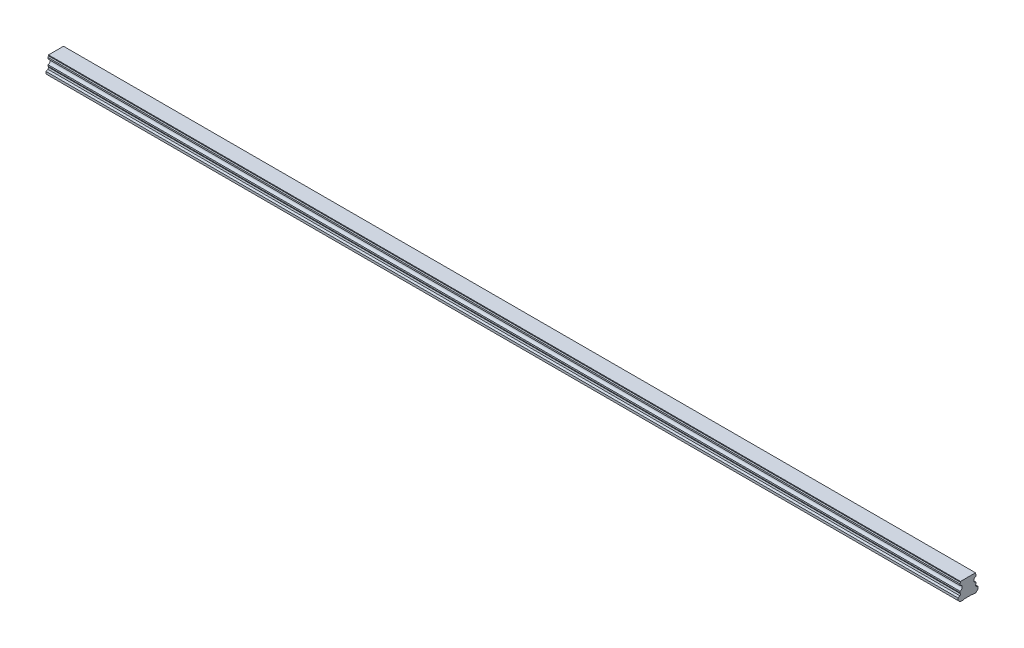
from build123d import *

# Parameters (mm, degrees)
BOSS_EXTRUDE1_DEPTH        = 1140
SKETCH3_R                  = 3
SKETCH3_R_2                = 2.5
CUT_EXTRUDE3_DEPTH         = 12
SKETCH3_2_R                = 2.5
CUT_EXTRUDE4_DEPTH         = 15
CHAMFER1_SIZE              = 0.5
LPATTERN4_COUNT            = 19
LPATTERN4_PITCH            = 60
CHAMFER1_OF_LPATTERN4_SIZE = 0.5


with BuildPart() as part:
    # Sketch1 → Boss-Extrude1 (new body)
    with BuildSketch(Plane(origin=(0, 0, 0), x_dir=(0, 0, -1), z_dir=(1, 0, 0))):
        with BuildLine():
            Line((9.375, 21.8), (-9.375, 21.8))
            Line((-9.375, 21.8), (-9.375, 20.756))
            Line((-9.375, 20.756), (-10, 19.415683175))
            Line((-10, 19.415683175), (-10, 17.685449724))
            ThreePointArc((-10, 17.685449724), (-7.2, 14.6), (-10, 11.514550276))
            Line((-10, 11.514550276), (-10, 9.784316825))
            Line((-10, 9.784316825), (-9.375, 8.444))
            Line((-9.375, 8.444), (-9.922688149, 6.4))
            Line((-9.922688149, 6.4), (-12.5, 5.489338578))
            Line((-12.5, 5.489338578), (-12.5, 2.65))
            Line((-12.5, 2.65), (-9.85, 0))
            Line((-9.85, 0), (-5.5, 0))
            Line((-5.5, 0), (-5, 0.5))
            Line((-5, 0.5), (5, 0.5))
            Line((5, 0.5), (5.5, 0))
            Line((5.5, 0), (9.85, 0))
            Line((9.85, 0), (12.5, 2.65))
            Line((12.5, 2.65), (12.5, 5.489338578))
            Line((12.5, 5.489338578), (9.922688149, 6.4))
            Line((9.922688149, 6.4), (9.375, 8.444))
            Line((9.375, 8.444), (10, 9.784316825))
            Line((10, 9.784316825), (10, 11.514550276))
            ThreePointArc((10, 11.514550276), (7.2, 14.6), (10, 17.685449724))
            Line((10, 17.685449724), (10, 19.415683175))
            Line((10, 19.415683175), (9.375, 20.756))
            Line((9.375, 20.756), (9.375, 21.8))
        make_face()
    extrude(amount=BOSS_EXTRUDE1_DEPTH)

    # Sketch3 → Cut-Extrude3 (cut)
    with BuildSketch(Plane.XZ):
        with Locations(Location((30, 0, 0), (0, 0, 270))):
            Circle(SKETCH3_R)
        with Locations(Location((30, 0, 0), (0, 0, 270))):
            Circle(SKETCH3_R_2, mode=Mode.SUBTRACT)
    cut_extrude3 = extrude(amount=-CUT_EXTRUDE3_DEPTH, mode=Mode.SUBTRACT)

    # Sketch3_2 → Cut-Extrude4 (cut)
    with BuildSketch(Plane.XZ):
        with Locations(Location((30, 0, 0), (0, 0, 270))):
            Circle(SKETCH3_2_R)
    cut_extrude4 = extrude(amount=-CUT_EXTRUDE4_DEPTH, mode=Mode.SUBTRACT)

    # Cut-Extrude5 cone 1 section (on through the dimple's axis) → Cut-Extrude5 (revolve, cut)
    with BuildSketch(Plane(origin=(30, 15, 0), x_dir=(0, 0, -1), z_dir=(1, 0, 0))):
        Polygon((0, 0), (2.5, 0), (0, 1.443375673), align=None)
    cut_extrude5 = revolve(axis=Axis((30, 15, 0), (0, 1, 0)), mode=Mode.SUBTRACT)

    # Chamfer1
    chamfer1_edges = [part.edges().sort_by_distance(p)[0] for p in [
        (30, 0.5, 3),
    ]]
    chamfer(chamfer1_edges, length=CHAMFER1_SIZE)

    # LPattern4: Cut-Extrude3, Cut-Extrude4, Cut-Extrude5 ×19
    with Locations(*[(i * LPATTERN4_PITCH, 0, 0) for i in range(1, LPATTERN4_COUNT)]):
        add(cut_extrude3, mode=Mode.SUBTRACT)
        add(cut_extrude4, mode=Mode.SUBTRACT)
        add(cut_extrude5, mode=Mode.SUBTRACT)

    # Chamfer1 of LPattern4
    chamfer1_of_lpattern4_edges = [part.edges().sort_by_distance(p)[0] for p in [
        (90, 0.5, 3),
        (150, 0.5, 3),
        (210, 0.5, 3),
        (270, 0.5, 3),
        (330, 0.5, 3),
        (390, 0.5, 3),
        (450, 0.5, 3),
        (510, 0.5, 3),
        (570, 0.5, 3),
        (630, 0.5, 3),
        (690, 0.5, 3),
        (750, 0.5, 3),
        (810, 0.5, 3),
        (870, 0.5, 3),
        (930, 0.5, 3),
        (990, 0.5, 3),
        (1050, 0.5, 3),
        (1110, 0.5, 3),
    ]]
    chamfer(chamfer1_of_lpattern4_edges, length=CHAMFER1_OF_LPATTERN4_SIZE)


solid = part.part
